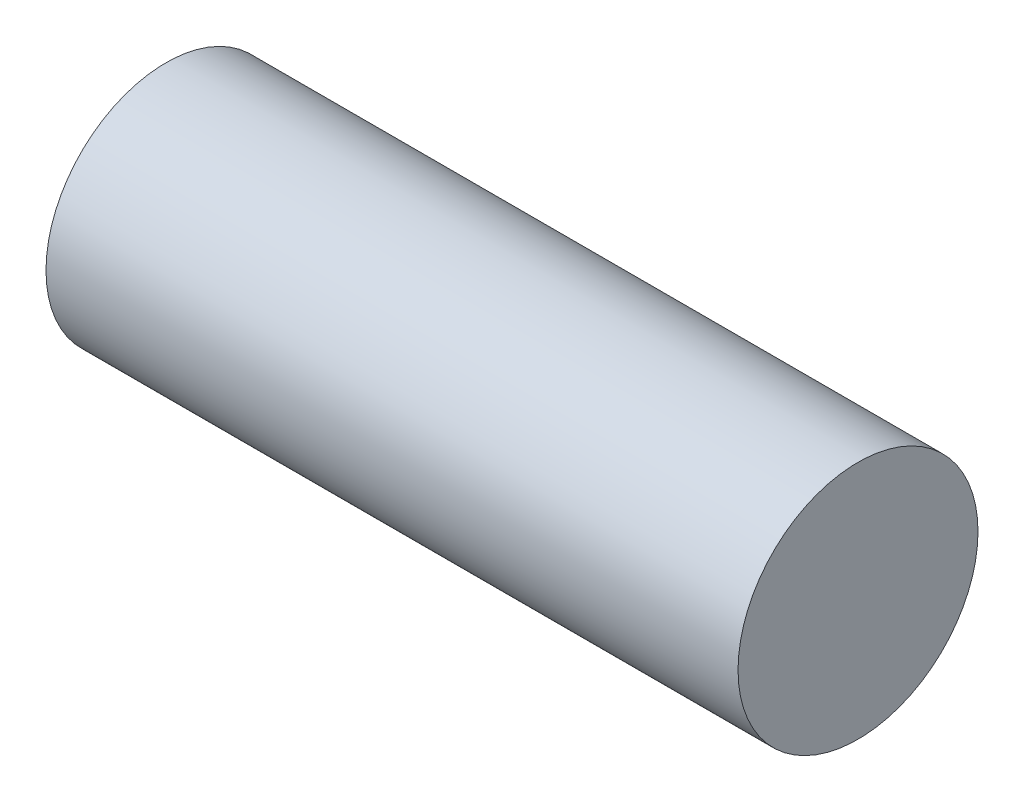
ISO-10303-21;
HEADER;
FILE_DESCRIPTION(('STEP AP214'),'2;1');
FILE_NAME('part.step','',(''),(''),'','','');
FILE_SCHEMA(('AUTOMOTIVE_DESIGN { 1 0 10303 214 1 1 1 1 }'));
ENDSEC;
DATA;
#1=APPLICATION_CONTEXT('core data for automotive mechanical design processes');
#2=APPLICATION_PROTOCOL_DEFINITION('international standard','automotive_design',2000,#1);
#3=PRODUCT_CONTEXT('',#1,'mechanical');
#4=PRODUCT('Part','Part','',(#3));
#5=PRODUCT_RELATED_PRODUCT_CATEGORY('part','',(#4));
#6=PRODUCT_DEFINITION_FORMATION('','',#4);
#7=PRODUCT_DEFINITION_CONTEXT('part definition',#1,'design');
#8=PRODUCT_DEFINITION('design','',#6,#7);
#9=PRODUCT_DEFINITION_SHAPE('','',#8);
#10=(LENGTH_UNIT() NAMED_UNIT(*) SI_UNIT(.MILLI.,.METRE.));
#11=(NAMED_UNIT(*) PLANE_ANGLE_UNIT() SI_UNIT($,.RADIAN.));
#12=(NAMED_UNIT(*) SI_UNIT($,.STERADIAN.) SOLID_ANGLE_UNIT());
#13=UNCERTAINTY_MEASURE_WITH_UNIT(LENGTH_MEASURE(1.E-05),#10,'distance_accuracy_value','');
#14=(GEOMETRIC_REPRESENTATION_CONTEXT(3) GLOBAL_UNCERTAINTY_ASSIGNED_CONTEXT((#13)) GLOBAL_UNIT_ASSIGNED_CONTEXT((#10,
#11,#12)) REPRESENTATION_CONTEXT('',''));
#15=CARTESIAN_POINT('',(0.,0.,0.));
#16=DIRECTION('',(0.,0.,1.));
#17=DIRECTION('',(1.,0.,0.));
#18=AXIS2_PLACEMENT_3D('',#15,#16,#17);
#19=CARTESIAN_POINT('',(53.5442946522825,0.,0.));
#20=DIRECTION('',(-1.,0.,0.));
#21=DIRECTION('',(0.,0.,1.));
#22=AXIS2_PLACEMENT_3D('',#19,#20,#21);
#23=CYLINDRICAL_SURFACE('',#22,1.7);
#24=CARTESIAN_POINT('',(53.5442946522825,0.,0.));
#25=DIRECTION('',(-1.,0.,0.));
#26=DIRECTION('',(0.,0.,1.));
#27=AXIS2_PLACEMENT_3D('',#24,#25,#26);
#28=CIRCLE('',#27,1.7);
#29=CARTESIAN_POINT('',(53.5442946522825,0.,1.7));
#30=VERTEX_POINT('',#29);
#31=EDGE_CURVE('E41',#30,#30,#28,.T.);
#32=ORIENTED_EDGE('',*,*,#31,.F.);
#33=EDGE_LOOP('',(#32));
#34=FACE_BOUND('',#33,.T.);
#35=CARTESIAN_POINT('',(63.35,0.,0.));
#36=DIRECTION('',(-1.,0.,0.));
#37=DIRECTION('',(0.,0.,1.));
#38=AXIS2_PLACEMENT_3D('',#35,#36,#37);
#39=CIRCLE('',#38,1.7);
#40=CARTESIAN_POINT('',(63.35,0.,1.7));
#41=VERTEX_POINT('',#40);
#42=EDGE_CURVE('E10',#41,#41,#39,.T.);
#43=ORIENTED_EDGE('',*,*,#42,.T.);
#44=EDGE_LOOP('',(#43));
#45=FACE_BOUND('',#44,.T.);
#46=ADVANCED_FACE('F35',(#34,#45),#23,.T.);
#47=CARTESIAN_POINT('',(63.35,1.7,0.));
#48=DIRECTION('',(-1.,0.,0.));
#49=DIRECTION('',(0.,0.,1.));
#50=AXIS2_PLACEMENT_3D('',#47,#48,#49);
#51=PLANE('',#50);
#52=ORIENTED_EDGE('',*,*,#42,.F.);
#53=EDGE_LOOP('',(#52));
#54=FACE_BOUND('',#53,.T.);
#55=ADVANCED_FACE('F51',(#54),#51,.F.);
#56=CARTESIAN_POINT('',(53.5442946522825,1.7,0.));
#57=DIRECTION('',(1.,0.,0.));
#58=DIRECTION('',(0.,0.,-1.));
#59=AXIS2_PLACEMENT_3D('',#56,#57,#58);
#60=PLANE('',#59);
#61=ORIENTED_EDGE('',*,*,#31,.T.);
#62=EDGE_LOOP('',(#61));
#63=FACE_BOUND('',#62,.T.);
#64=ADVANCED_FACE('F48',(#63),#60,.F.);
#65=CLOSED_SHELL('',(#46,#55,#64));
#66=MANIFOLD_SOLID_BREP('B2',#65);
#67=ADVANCED_BREP_SHAPE_REPRESENTATION('',(#18,#66),#14);
#68=SHAPE_DEFINITION_REPRESENTATION(#9,#67);
ENDSEC;
END-ISO-10303-21;
